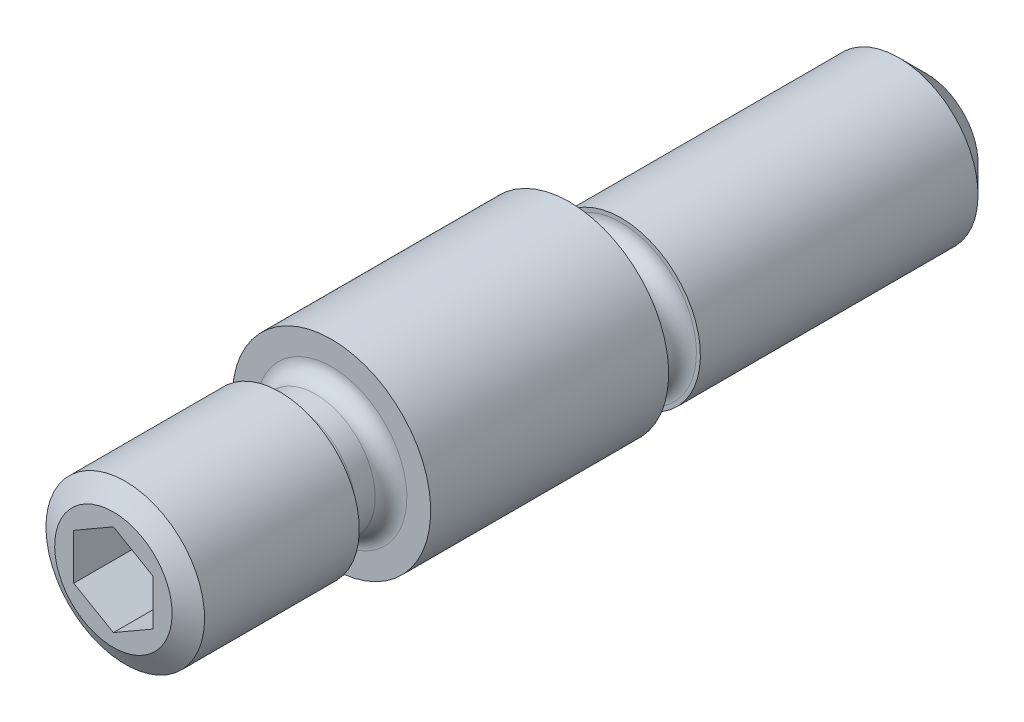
ISO-10303-21;
HEADER;
FILE_DESCRIPTION(('STEP AP214'),'2;1');
FILE_NAME('part.step','',(''),(''),'','','');
FILE_SCHEMA(('AUTOMOTIVE_DESIGN { 1 0 10303 214 1 1 1 1 }'));
ENDSEC;
DATA;
#1=APPLICATION_CONTEXT('core data for automotive mechanical design processes');
#2=APPLICATION_PROTOCOL_DEFINITION('international standard','automotive_design',2000,#1);
#3=PRODUCT_CONTEXT('',#1,'mechanical');
#4=PRODUCT('Part','Part','',(#3));
#5=PRODUCT_RELATED_PRODUCT_CATEGORY('part','',(#4));
#6=PRODUCT_DEFINITION_FORMATION('','',#4);
#7=PRODUCT_DEFINITION_CONTEXT('part definition',#1,'design');
#8=PRODUCT_DEFINITION('design','',#6,#7);
#9=PRODUCT_DEFINITION_SHAPE('','',#8);
#10=(LENGTH_UNIT() NAMED_UNIT(*) SI_UNIT(.MILLI.,.METRE.));
#11=(NAMED_UNIT(*) PLANE_ANGLE_UNIT() SI_UNIT($,.RADIAN.));
#12=(NAMED_UNIT(*) SI_UNIT($,.STERADIAN.) SOLID_ANGLE_UNIT());
#13=UNCERTAINTY_MEASURE_WITH_UNIT(LENGTH_MEASURE(1.E-05),#10,'distance_accuracy_value','');
#14=(GEOMETRIC_REPRESENTATION_CONTEXT(3) GLOBAL_UNCERTAINTY_ASSIGNED_CONTEXT((#13)) GLOBAL_UNIT_ASSIGNED_CONTEXT((#10,
#11,#12)) REPRESENTATION_CONTEXT('',''));
#15=CARTESIAN_POINT('',(0.,0.,0.));
#16=DIRECTION('',(0.,0.,1.));
#17=DIRECTION('',(1.,0.,0.));
#18=AXIS2_PLACEMENT_3D('',#15,#16,#17);
#19=CARTESIAN_POINT('',(0.,2.,-9.));
#20=DIRECTION('',(0.,0.,-1.));
#21=DIRECTION('',(0.,1.,0.));
#22=AXIS2_PLACEMENT_3D('',#19,#20,#21);
#23=PLANE('',#22);
#24=CARTESIAN_POINT('',(0.,0.,-9.));
#25=DIRECTION('',(0.,0.,-1.));
#26=DIRECTION('',(0.,1.,0.));
#27=AXIS2_PLACEMENT_3D('',#24,#25,#26);
#28=CIRCLE('',#27,1.3);
#29=CARTESIAN_POINT('',(0.,1.3,-9.));
#30=VERTEX_POINT('',#29);
#31=EDGE_CURVE('E22',#30,#30,#28,.T.);
#32=ORIENTED_EDGE('',*,*,#31,.T.);
#33=EDGE_LOOP('',(#32));
#34=FACE_BOUND('',#33,.T.);
#35=ADVANCED_FACE('F14',(#34),#23,.T.);
#36=CARTESIAN_POINT('',(0.,0.,-9.));
#37=DIRECTION('',(0.,0.,-1.));
#38=DIRECTION('',(0.,1.,0.));
#39=AXIS2_PLACEMENT_3D('',#36,#37,#38);
#40=CYLINDRICAL_SURFACE('',#39,1.5);
#41=CARTESIAN_POINT('',(0.,0.,-0.9));
#42=DIRECTION('',(0.,0.,1.));
#43=DIRECTION('',(0.,-1.,0.));
#44=AXIS2_PLACEMENT_3D('',#41,#42,#43);
#45=CIRCLE('',#44,1.5);
#46=CARTESIAN_POINT('',(0.,-1.5,-0.9));
#47=VERTEX_POINT('',#46);
#48=EDGE_CURVE('E154',#47,#47,#45,.T.);
#49=ORIENTED_EDGE('',*,*,#48,.T.);
#50=EDGE_LOOP('',(#49));
#51=FACE_BOUND('',#50,.T.);
#52=CARTESIAN_POINT('',(0.,0.,-0.4));
#53=DIRECTION('',(0.,0.,-1.));
#54=DIRECTION('',(0.,1.,0.));
#55=AXIS2_PLACEMENT_3D('',#52,#53,#54);
#56=CIRCLE('',#55,1.5);
#57=CARTESIAN_POINT('',(0.,1.5,-0.4));
#58=VERTEX_POINT('',#57);
#59=EDGE_CURVE('E151',#58,#58,#56,.T.);
#60=ORIENTED_EDGE('',*,*,#59,.T.);
#61=EDGE_LOOP('',(#60));
#62=FACE_BOUND('',#61,.T.);
#63=ADVANCED_FACE('F176',(#51,#62),#40,.T.);
#64=CARTESIAN_POINT('',(0.,1.5,-1.3));
#65=DIRECTION('',(0.,0.,1.));
#66=DIRECTION('',(0.,-1.,0.));
#67=AXIS2_PLACEMENT_3D('',#64,#65,#66);
#68=PLANE('',#67);
#69=CARTESIAN_POINT('',(0.,0.,-1.3));
#70=DIRECTION('',(0.,0.,1.));
#71=DIRECTION('',(0.,-1.,0.));
#72=AXIS2_PLACEMENT_3D('',#69,#70,#71);
#73=CIRCLE('',#72,1.9);
#74=CARTESIAN_POINT('',(0.,-1.9,-1.3));
#75=VERTEX_POINT('',#74);
#76=EDGE_CURVE('E148',#75,#75,#73,.F.);
#77=ORIENTED_EDGE('',*,*,#76,.T.);
#78=EDGE_LOOP('',(#77));
#79=FACE_BOUND('',#78,.T.);
#80=CARTESIAN_POINT('',(0.,0.,-1.3));
#81=DIRECTION('',(0.,0.,-1.));
#82=DIRECTION('',(0.,1.,0.));
#83=AXIS2_PLACEMENT_3D('',#80,#81,#82);
#84=CIRCLE('',#83,2.);
#85=CARTESIAN_POINT('',(0.,2.,-1.3));
#86=VERTEX_POINT('',#85);
#87=EDGE_CURVE('E136',#86,#86,#84,.T.);
#88=ORIENTED_EDGE('',*,*,#87,.F.);
#89=EDGE_LOOP('',(#88));
#90=FACE_BOUND('',#89,.T.);
#91=ADVANCED_FACE('F181',(#79,#90),#68,.T.);
#92=CARTESIAN_POINT('',(0.,0.,-9.));
#93=DIRECTION('',(0.,0.,-1.));
#94=DIRECTION('',(0.,1.,0.));
#95=AXIS2_PLACEMENT_3D('',#92,#93,#94);
#96=CYLINDRICAL_SURFACE('',#95,2.);
#97=CARTESIAN_POINT('',(0.,0.,-8.3));
#98=DIRECTION('',(0.,0.,-1.));
#99=DIRECTION('',(0.,1.,0.));
#100=AXIS2_PLACEMENT_3D('',#97,#98,#99);
#101=CIRCLE('',#100,2.);
#102=CARTESIAN_POINT('',(0.,2.,-8.3));
#103=VERTEX_POINT('',#102);
#104=EDGE_CURVE('E9',#103,#103,#101,.F.);
#105=ORIENTED_EDGE('',*,*,#104,.T.);
#106=EDGE_LOOP('',(#105));
#107=FACE_BOUND('',#106,.T.);
#108=ORIENTED_EDGE('',*,*,#87,.T.);
#109=EDGE_LOOP('',(#108));
#110=FACE_BOUND('',#109,.T.);
#111=ADVANCED_FACE('F235',(#107,#110),#96,.T.);
#112=CARTESIAN_POINT('',(0.,0.5,0.));
#113=DIRECTION('',(0.,0.,-1.));
#114=DIRECTION('',(0.,1.,0.));
#115=AXIS2_PLACEMENT_3D('',#112,#113,#114);
#116=PLANE('',#115);
#117=CARTESIAN_POINT('',(0.,0.,0.));
#118=DIRECTION('',(0.,0.,-1.));
#119=DIRECTION('',(0.,1.,0.));
#120=AXIS2_PLACEMENT_3D('',#117,#118,#119);
#121=CIRCLE('',#120,1.9);
#122=CARTESIAN_POINT('',(0.,1.9,0.));
#123=VERTEX_POINT('',#122);
#124=EDGE_CURVE('E157',#123,#123,#121,.F.);
#125=ORIENTED_EDGE('',*,*,#124,.T.);
#126=EDGE_LOOP('',(#125));
#127=FACE_BOUND('',#126,.T.);
#128=CARTESIAN_POINT('',(0.,0.5,0.));
#129=DIRECTION('',(0.,0.,-1.));
#130=DIRECTION('',(0.,1.,0.));
#131=AXIS2_PLACEMENT_3D('',#128,#129,#130);
#132=CIRCLE('',#131,2.5);
#133=CARTESIAN_POINT('',(0.,3.,0.));
#134=VERTEX_POINT('',#133);
#135=EDGE_CURVE('E133',#134,#134,#132,.T.);
#136=ORIENTED_EDGE('',*,*,#135,.T.);
#137=EDGE_LOOP('',(#136));
#138=FACE_BOUND('',#137,.T.);
#139=ADVANCED_FACE('F231',(#127,#138),#116,.T.);
#140=CARTESIAN_POINT('',(0.,0.5,0.));
#141=DIRECTION('',(0.,0.,-1.));
#142=DIRECTION('',(0.,1.,0.));
#143=AXIS2_PLACEMENT_3D('',#140,#141,#142);
#144=CYLINDRICAL_SURFACE('',#143,2.5);
#145=CARTESIAN_POINT('',(0.,0.5,6.));
#146=DIRECTION('',(0.,0.,-1.));
#147=DIRECTION('',(0.,1.,0.));
#148=AXIS2_PLACEMENT_3D('',#145,#146,#147);
#149=CIRCLE('',#148,2.5);
#150=CARTESIAN_POINT('',(0.,3.,6.));
#151=VERTEX_POINT('',#150);
#152=EDGE_CURVE('E130',#151,#151,#149,.T.);
#153=ORIENTED_EDGE('',*,*,#152,.T.);
#154=EDGE_LOOP('',(#153));
#155=FACE_BOUND('',#154,.T.);
#156=ORIENTED_EDGE('',*,*,#135,.F.);
#157=EDGE_LOOP('',(#156));
#158=FACE_BOUND('',#157,.T.);
#159=ADVANCED_FACE('F224',(#155,#158),#144,.T.);
#160=CARTESIAN_POINT('',(0.,3.,6.));
#161=DIRECTION('',(0.,0.,1.));
#162=DIRECTION('',(0.,-1.,0.));
#163=AXIS2_PLACEMENT_3D('',#160,#161,#162);
#164=PLANE('',#163);
#165=CARTESIAN_POINT('',(0.,0.5,6.));
#166=DIRECTION('',(0.,0.,1.));
#167=DIRECTION('',(0.,-1.,0.));
#168=AXIS2_PLACEMENT_3D('',#165,#166,#167);
#169=CIRCLE('',#168,1.9);
#170=CARTESIAN_POINT('',(0.,-1.4,6.));
#171=VERTEX_POINT('',#170);
#172=EDGE_CURVE('E139',#171,#171,#169,.F.);
#173=ORIENTED_EDGE('',*,*,#172,.T.);
#174=EDGE_LOOP('',(#173));
#175=FACE_BOUND('',#174,.T.);
#176=ORIENTED_EDGE('',*,*,#152,.F.);
#177=EDGE_LOOP('',(#176));
#178=FACE_BOUND('',#177,.T.);
#179=ADVANCED_FACE('F214',(#175,#178),#164,.T.);
#180=CARTESIAN_POINT('',(0.,0.5,0.));
#181=DIRECTION('',(0.,0.,-1.));
#182=DIRECTION('',(0.,1.,0.));
#183=AXIS2_PLACEMENT_3D('',#180,#181,#182);
#184=CYLINDRICAL_SURFACE('',#183,1.5);
#185=CARTESIAN_POINT('',(0.,0.5,6.4));
#186=DIRECTION('',(0.,0.,1.));
#187=DIRECTION('',(0.,-1.,0.));
#188=AXIS2_PLACEMENT_3D('',#185,#186,#187);
#189=CIRCLE('',#188,1.5);
#190=CARTESIAN_POINT('',(0.,-1.,6.4));
#191=VERTEX_POINT('',#190);
#192=EDGE_CURVE('E145',#191,#191,#189,.T.);
#193=ORIENTED_EDGE('',*,*,#192,.T.);
#194=EDGE_LOOP('',(#193));
#195=FACE_BOUND('',#194,.T.);
#196=CARTESIAN_POINT('',(0.,0.5,6.9));
#197=DIRECTION('',(0.,0.,-1.));
#198=DIRECTION('',(0.,1.,0.));
#199=AXIS2_PLACEMENT_3D('',#196,#197,#198);
#200=CIRCLE('',#199,1.5);
#201=CARTESIAN_POINT('',(0.,2.,6.9));
#202=VERTEX_POINT('',#201);
#203=EDGE_CURVE('E142',#202,#202,#200,.T.);
#204=ORIENTED_EDGE('',*,*,#203,.T.);
#205=EDGE_LOOP('',(#204));
#206=FACE_BOUND('',#205,.T.);
#207=ADVANCED_FACE('F211',(#195,#206),#184,.T.);
#208=CARTESIAN_POINT('',(0.,2.,7.3));
#209=DIRECTION('',(0.,0.,-1.));
#210=DIRECTION('',(0.,1.,0.));
#211=AXIS2_PLACEMENT_3D('',#208,#209,#210);
#212=PLANE('',#211);
#213=CARTESIAN_POINT('',(0.,0.5,7.3));
#214=DIRECTION('',(0.,0.,-1.));
#215=DIRECTION('',(0.,1.,0.));
#216=AXIS2_PLACEMENT_3D('',#213,#214,#215);
#217=CIRCLE('',#216,1.9);
#218=CARTESIAN_POINT('',(0.,2.4,7.3));
#219=VERTEX_POINT('',#218);
#220=EDGE_CURVE('E160',#219,#219,#217,.F.);
#221=ORIENTED_EDGE('',*,*,#220,.T.);
#222=EDGE_LOOP('',(#221));
#223=FACE_BOUND('',#222,.T.);
#224=CARTESIAN_POINT('',(0.,0.5,7.3));
#225=DIRECTION('',(0.,0.,-1.));
#226=DIRECTION('',(0.,1.,0.));
#227=AXIS2_PLACEMENT_3D('',#224,#225,#226);
#228=CIRCLE('',#227,2.);
#229=CARTESIAN_POINT('',(0.,2.5,7.3));
#230=VERTEX_POINT('',#229);
#231=EDGE_CURVE('E127',#230,#230,#228,.T.);
#232=ORIENTED_EDGE('',*,*,#231,.T.);
#233=EDGE_LOOP('',(#232));
#234=FACE_BOUND('',#233,.T.);
#235=ADVANCED_FACE('F213',(#223,#234),#212,.T.);
#236=CARTESIAN_POINT('',(0.,0.5,0.));
#237=DIRECTION('',(0.,0.,-1.));
#238=DIRECTION('',(0.,1.,0.));
#239=AXIS2_PLACEMENT_3D('',#236,#237,#238);
#240=CYLINDRICAL_SURFACE('',#239,2.);
#241=CARTESIAN_POINT('',(0.,0.5,11.2));
#242=DIRECTION('',(0.,0.,-1.));
#243=DIRECTION('',(0.,1.,0.));
#244=AXIS2_PLACEMENT_3D('',#241,#242,#243);
#245=CIRCLE('',#244,2.);
#246=CARTESIAN_POINT('',(0.,2.5,11.2));
#247=VERTEX_POINT('',#246);
#248=EDGE_CURVE('E124',#247,#247,#245,.T.);
#249=ORIENTED_EDGE('',*,*,#248,.T.);
#250=EDGE_LOOP('',(#249));
#251=FACE_BOUND('',#250,.T.);
#252=ORIENTED_EDGE('',*,*,#231,.F.);
#253=EDGE_LOOP('',(#252));
#254=FACE_BOUND('',#253,.T.);
#255=ADVANCED_FACE('F221',(#251,#254),#240,.T.);
#256=CARTESIAN_POINT('',(0.,0.5,11.2));
#257=DIRECTION('',(0.,0.,-1.));
#258=DIRECTION('',(0.,1.,0.));
#259=AXIS2_PLACEMENT_3D('',#256,#257,#258);
#260=CONICAL_SURFACE('',#259,2.,1.0471975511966);
#261=CARTESIAN_POINT('',(0.,0.5,11.5));
#262=DIRECTION('',(0.,0.,-1.));
#263=DIRECTION('',(0.,1.,0.));
#264=AXIS2_PLACEMENT_3D('',#261,#262,#263);
#265=CIRCLE('',#264,1.48038475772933);
#266=CARTESIAN_POINT('',(0.,1.98038475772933,11.5));
#267=VERTEX_POINT('',#266);
#268=EDGE_CURVE('E116',#267,#267,#265,.T.);
#269=ORIENTED_EDGE('',*,*,#268,.T.);
#270=EDGE_LOOP('',(#269));
#271=FACE_BOUND('',#270,.T.);
#272=ORIENTED_EDGE('',*,*,#248,.F.);
#273=EDGE_LOOP('',(#272));
#274=FACE_BOUND('',#273,.T.);
#275=ADVANCED_FACE('F296',(#271,#274),#260,.T.);
#276=CARTESIAN_POINT('',(0.,0.5,11.5));
#277=DIRECTION('',(0.,0.,1.));
#278=DIRECTION('',(0.,-1.,0.));
#279=AXIS2_PLACEMENT_3D('',#276,#277,#278);
#280=PLANE('',#279);
#281=DIRECTION('',(-0.866025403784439,0.5,0.));
#282=VECTOR('',#281,1.);
#283=CARTESIAN_POINT('',(1.,1.07735026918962,11.5));
#284=LINE('',#283,#282);
#285=CARTESIAN_POINT('',(1.,1.07735026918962,11.5));
#286=VERTEX_POINT('',#285);
#287=CARTESIAN_POINT('',(0.,1.65470053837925,11.5));
#288=VERTEX_POINT('',#287);
#289=EDGE_CURVE('E29',#286,#288,#284,.T.);
#290=ORIENTED_EDGE('',*,*,#289,.F.);
#291=DIRECTION('',(0.,1.,0.));
#292=VECTOR('',#291,1.);
#293=CARTESIAN_POINT('',(1.,-0.0773502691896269,11.5));
#294=LINE('',#293,#292);
#295=CARTESIAN_POINT('',(1.,-0.0773502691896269,11.5));
#296=VERTEX_POINT('',#295);
#297=EDGE_CURVE('E112',#296,#286,#294,.T.);
#298=ORIENTED_EDGE('',*,*,#297,.F.);
#299=DIRECTION('',(0.866025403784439,0.5,0.));
#300=VECTOR('',#299,1.);
#301=CARTESIAN_POINT('',(0.,-0.654700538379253,11.5));
#302=LINE('',#301,#300);
#303=CARTESIAN_POINT('',(0.,-0.654700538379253,11.5));
#304=VERTEX_POINT('',#303);
#305=EDGE_CURVE('E110',#304,#296,#302,.T.);
#306=ORIENTED_EDGE('',*,*,#305,.F.);
#307=DIRECTION('',(0.866025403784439,-0.5,0.));
#308=VECTOR('',#307,1.);
#309=CARTESIAN_POINT('',(-1.,-0.0773502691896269,11.5));
#310=LINE('',#309,#308);
#311=CARTESIAN_POINT('',(-1.,-0.0773502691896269,11.5));
#312=VERTEX_POINT('',#311);
#313=EDGE_CURVE('E77',#312,#304,#310,.T.);
#314=ORIENTED_EDGE('',*,*,#313,.F.);
#315=DIRECTION('',(0.,-1.,0.));
#316=VECTOR('',#315,1.);
#317=CARTESIAN_POINT('',(-1.,1.07735026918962,11.5));
#318=LINE('',#317,#316);
#319=CARTESIAN_POINT('',(-1.,1.07735026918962,11.5));
#320=VERTEX_POINT('',#319);
#321=EDGE_CURVE('E106',#320,#312,#318,.T.);
#322=ORIENTED_EDGE('',*,*,#321,.F.);
#323=DIRECTION('',(-0.866025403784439,-0.5,0.));
#324=VECTOR('',#323,1.);
#325=CARTESIAN_POINT('',(0.,1.65470053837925,11.5));
#326=LINE('',#325,#324);
#327=EDGE_CURVE('E103',#288,#320,#326,.T.);
#328=ORIENTED_EDGE('',*,*,#327,.F.);
#329=EDGE_LOOP('',(#290,#298,#306,#314,#322,#328));
#330=FACE_BOUND('',#329,.T.);
#331=ORIENTED_EDGE('',*,*,#268,.F.);
#332=EDGE_LOOP('',(#331));
#333=FACE_BOUND('',#332,.T.);
#334=ADVANCED_FACE('F190',(#330,#333),#280,.T.);
#335=CARTESIAN_POINT('',(0.,0.5,6.4));
#336=DIRECTION('',(0.,0.,1.));
#337=DIRECTION('',(0.,-1.,0.));
#338=AXIS2_PLACEMENT_3D('',#335,#336,#337);
#339=TOROIDAL_SURFACE('',#338,1.9,0.4);
#340=ORIENTED_EDGE('',*,*,#192,.F.);
#341=EDGE_LOOP('',(#340));
#342=FACE_BOUND('',#341,.T.);
#343=ORIENTED_EDGE('',*,*,#172,.F.);
#344=EDGE_LOOP('',(#343));
#345=FACE_BOUND('',#344,.T.);
#346=ADVANCED_FACE('F186',(#342,#345),#339,.F.);
#347=CARTESIAN_POINT('',(0.,0.,-0.9));
#348=DIRECTION('',(0.,0.,1.));
#349=DIRECTION('',(0.,-1.,0.));
#350=AXIS2_PLACEMENT_3D('',#347,#348,#349);
#351=TOROIDAL_SURFACE('',#350,1.9,0.4);
#352=ORIENTED_EDGE('',*,*,#48,.F.);
#353=EDGE_LOOP('',(#352));
#354=FACE_BOUND('',#353,.T.);
#355=ORIENTED_EDGE('',*,*,#76,.F.);
#356=EDGE_LOOP('',(#355));
#357=FACE_BOUND('',#356,.T.);
#358=ADVANCED_FACE('F189',(#354,#357),#351,.F.);
#359=CARTESIAN_POINT('',(0.,0.,-0.4));
#360=DIRECTION('',(0.,0.,-1.));
#361=DIRECTION('',(0.,1.,0.));
#362=AXIS2_PLACEMENT_3D('',#359,#360,#361);
#363=TOROIDAL_SURFACE('',#362,1.9,0.4);
#364=ORIENTED_EDGE('',*,*,#59,.F.);
#365=EDGE_LOOP('',(#364));
#366=FACE_BOUND('',#365,.T.);
#367=ORIENTED_EDGE('',*,*,#124,.F.);
#368=EDGE_LOOP('',(#367));
#369=FACE_BOUND('',#368,.T.);
#370=ADVANCED_FACE('F194',(#366,#369),#363,.F.);
#371=CARTESIAN_POINT('',(0.,0.5,6.9));
#372=DIRECTION('',(0.,0.,-1.));
#373=DIRECTION('',(0.,1.,0.));
#374=AXIS2_PLACEMENT_3D('',#371,#372,#373);
#375=TOROIDAL_SURFACE('',#374,1.9,0.4);
#376=ORIENTED_EDGE('',*,*,#220,.F.);
#377=EDGE_LOOP('',(#376));
#378=FACE_BOUND('',#377,.T.);
#379=ORIENTED_EDGE('',*,*,#203,.F.);
#380=EDGE_LOOP('',(#379));
#381=FACE_BOUND('',#380,.T.);
#382=ADVANCED_FACE('F197',(#378,#381),#375,.F.);
#383=CARTESIAN_POINT('',(1.,1.07735026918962,9.));
#384=DIRECTION('',(0.5,0.866025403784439,0.));
#385=DIRECTION('',(0.866025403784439,-0.5,0.));
#386=AXIS2_PLACEMENT_3D('',#383,#384,#385);
#387=PLANE('',#386);
#388=ORIENTED_EDGE('',*,*,#289,.T.);
#389=DIRECTION('',(0.,0.,1.));
#390=VECTOR('',#389,1.);
#391=CARTESIAN_POINT('',(0.,1.65470053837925,9.));
#392=LINE('',#391,#390);
#393=CARTESIAN_POINT('',(0.,1.65470053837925,9.));
#394=VERTEX_POINT('',#393);
#395=EDGE_CURVE('E59',#394,#288,#392,.T.);
#396=ORIENTED_EDGE('',*,*,#395,.F.);
#397=DIRECTION('',(-0.866025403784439,0.5,0.));
#398=VECTOR('',#397,1.);
#399=CARTESIAN_POINT('',(1.,1.07735026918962,9.));
#400=LINE('',#399,#398);
#401=CARTESIAN_POINT('',(1.,1.07735026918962,9.));
#402=VERTEX_POINT('',#401);
#403=EDGE_CURVE('E114',#402,#394,#400,.T.);
#404=ORIENTED_EDGE('',*,*,#403,.F.);
#405=DIRECTION('',(0.,0.,1.));
#406=VECTOR('',#405,1.);
#407=CARTESIAN_POINT('',(1.,1.07735026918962,9.));
#408=LINE('',#407,#406);
#409=EDGE_CURVE('E37',#402,#286,#408,.T.);
#410=ORIENTED_EDGE('',*,*,#409,.T.);
#411=EDGE_LOOP('',(#388,#396,#404,#410));
#412=FACE_BOUND('',#411,.T.);
#413=ADVANCED_FACE('F200',(#412),#387,.F.);
#414=CARTESIAN_POINT('',(1.,-0.0773502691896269,9.));
#415=DIRECTION('',(1.,0.,0.));
#416=DIRECTION('',(0.,0.,-1.));
#417=AXIS2_PLACEMENT_3D('',#414,#415,#416);
#418=PLANE('',#417);
#419=ORIENTED_EDGE('',*,*,#297,.T.);
#420=ORIENTED_EDGE('',*,*,#409,.F.);
#421=DIRECTION('',(0.,1.,0.));
#422=VECTOR('',#421,1.);
#423=CARTESIAN_POINT('',(1.,-0.0773502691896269,9.));
#424=LINE('',#423,#422);
#425=CARTESIAN_POINT('',(1.,-0.0773502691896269,9.));
#426=VERTEX_POINT('',#425);
#427=EDGE_CURVE('E89',#426,#402,#424,.T.);
#428=ORIENTED_EDGE('',*,*,#427,.F.);
#429=DIRECTION('',(0.,0.,1.));
#430=VECTOR('',#429,1.);
#431=CARTESIAN_POINT('',(1.,-0.0773502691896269,9.));
#432=LINE('',#431,#430);
#433=EDGE_CURVE('E81',#426,#296,#432,.T.);
#434=ORIENTED_EDGE('',*,*,#433,.T.);
#435=EDGE_LOOP('',(#419,#420,#428,#434));
#436=FACE_BOUND('',#435,.T.);
#437=ADVANCED_FACE('F205',(#436),#418,.F.);
#438=CARTESIAN_POINT('',(0.,-0.654700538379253,9.));
#439=DIRECTION('',(0.5,-0.866025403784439,0.));
#440=DIRECTION('',(-0.866025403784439,-0.5,0.));
#441=AXIS2_PLACEMENT_3D('',#438,#439,#440);
#442=PLANE('',#441);
#443=ORIENTED_EDGE('',*,*,#305,.T.);
#444=ORIENTED_EDGE('',*,*,#433,.F.);
#445=DIRECTION('',(0.866025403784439,0.5,0.));
#446=VECTOR('',#445,1.);
#447=CARTESIAN_POINT('',(0.,-0.654700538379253,9.));
#448=LINE('',#447,#446);
#449=CARTESIAN_POINT('',(0.,-0.654700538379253,9.));
#450=VERTEX_POINT('',#449);
#451=EDGE_CURVE('E85',#450,#426,#448,.T.);
#452=ORIENTED_EDGE('',*,*,#451,.F.);
#453=DIRECTION('',(0.,0.,1.));
#454=VECTOR('',#453,1.);
#455=CARTESIAN_POINT('',(0.,-0.654700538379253,9.));
#456=LINE('',#455,#454);
#457=EDGE_CURVE('E70',#450,#304,#456,.T.);
#458=ORIENTED_EDGE('',*,*,#457,.T.);
#459=EDGE_LOOP('',(#443,#444,#452,#458));
#460=FACE_BOUND('',#459,.T.);
#461=ADVANCED_FACE('F86',(#460),#442,.F.);
#462=CARTESIAN_POINT('',(-1.,-0.0773502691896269,9.));
#463=DIRECTION('',(-0.5,-0.866025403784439,0.));
#464=DIRECTION('',(-0.866025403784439,0.5,0.));
#465=AXIS2_PLACEMENT_3D('',#462,#463,#464);
#466=PLANE('',#465);
#467=ORIENTED_EDGE('',*,*,#313,.T.);
#468=ORIENTED_EDGE('',*,*,#457,.F.);
#469=DIRECTION('',(0.866025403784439,-0.5,0.));
#470=VECTOR('',#469,1.);
#471=CARTESIAN_POINT('',(-1.,-0.0773502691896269,9.));
#472=LINE('',#471,#470);
#473=CARTESIAN_POINT('',(-1.,-0.0773502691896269,9.));
#474=VERTEX_POINT('',#473);
#475=EDGE_CURVE('E74',#474,#450,#472,.T.);
#476=ORIENTED_EDGE('',*,*,#475,.F.);
#477=DIRECTION('',(0.,0.,1.));
#478=VECTOR('',#477,1.);
#479=CARTESIAN_POINT('',(-1.,-0.0773502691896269,9.));
#480=LINE('',#479,#478);
#481=EDGE_CURVE('E82',#474,#312,#480,.T.);
#482=ORIENTED_EDGE('',*,*,#481,.T.);
#483=EDGE_LOOP('',(#467,#468,#476,#482));
#484=FACE_BOUND('',#483,.T.);
#485=ADVANCED_FACE('F72',(#484),#466,.F.);
#486=CARTESIAN_POINT('',(-1.,1.07735026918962,9.));
#487=DIRECTION('',(-1.,0.,0.));
#488=DIRECTION('',(0.,0.,1.));
#489=AXIS2_PLACEMENT_3D('',#486,#487,#488);
#490=PLANE('',#489);
#491=ORIENTED_EDGE('',*,*,#321,.T.);
#492=ORIENTED_EDGE('',*,*,#481,.F.);
#493=DIRECTION('',(0.,-1.,0.));
#494=VECTOR('',#493,1.);
#495=CARTESIAN_POINT('',(-1.,1.07735026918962,9.));
#496=LINE('',#495,#494);
#497=CARTESIAN_POINT('',(-1.,1.07735026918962,9.));
#498=VERTEX_POINT('',#497);
#499=EDGE_CURVE('E95',#498,#474,#496,.T.);
#500=ORIENTED_EDGE('',*,*,#499,.F.);
#501=DIRECTION('',(0.,0.,1.));
#502=VECTOR('',#501,1.);
#503=CARTESIAN_POINT('',(-1.,1.07735026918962,9.));
#504=LINE('',#503,#502);
#505=EDGE_CURVE('E119',#498,#320,#504,.T.);
#506=ORIENTED_EDGE('',*,*,#505,.T.);
#507=EDGE_LOOP('',(#491,#492,#500,#506));
#508=FACE_BOUND('',#507,.T.);
#509=ADVANCED_FACE('F367',(#508),#490,.F.);
#510=CARTESIAN_POINT('',(0.,1.65470053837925,9.));
#511=DIRECTION('',(-0.5,0.866025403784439,0.));
#512=DIRECTION('',(0.866025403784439,0.5,0.));
#513=AXIS2_PLACEMENT_3D('',#510,#511,#512);
#514=PLANE('',#513);
#515=ORIENTED_EDGE('',*,*,#327,.T.);
#516=ORIENTED_EDGE('',*,*,#505,.F.);
#517=DIRECTION('',(-0.866025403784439,-0.5,0.));
#518=VECTOR('',#517,1.);
#519=CARTESIAN_POINT('',(0.,1.65470053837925,9.));
#520=LINE('',#519,#518);
#521=EDGE_CURVE('E97',#394,#498,#520,.T.);
#522=ORIENTED_EDGE('',*,*,#521,.F.);
#523=ORIENTED_EDGE('',*,*,#395,.T.);
#524=EDGE_LOOP('',(#515,#516,#522,#523));
#525=FACE_BOUND('',#524,.T.);
#526=ADVANCED_FACE('F172',(#525),#514,.F.);
#527=CARTESIAN_POINT('',(0.,1.65470053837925,9.));
#528=DIRECTION('',(0.,0.,1.));
#529=DIRECTION('',(1.,0.,0.));
#530=AXIS2_PLACEMENT_3D('',#527,#528,#529);
#531=PLANE('',#530);
#532=ORIENTED_EDGE('',*,*,#403,.T.);
#533=ORIENTED_EDGE('',*,*,#521,.T.);
#534=ORIENTED_EDGE('',*,*,#499,.T.);
#535=ORIENTED_EDGE('',*,*,#475,.T.);
#536=ORIENTED_EDGE('',*,*,#451,.T.);
#537=ORIENTED_EDGE('',*,*,#427,.T.);
#538=EDGE_LOOP('',(#532,#533,#534,#535,#536,#537));
#539=FACE_BOUND('',#538,.T.);
#540=ADVANCED_FACE('F92',(#539),#531,.T.);
#541=CARTESIAN_POINT('',(0.,0.,-9.));
#542=DIRECTION('',(0.,0.,1.));
#543=DIRECTION('',(0.,-1.,0.));
#544=AXIS2_PLACEMENT_3D('',#541,#542,#543);
#545=CONICAL_SURFACE('',#544,1.3,0.785398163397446);
#546=ORIENTED_EDGE('',*,*,#104,.F.);
#547=EDGE_LOOP('',(#546));
#548=FACE_BOUND('',#547,.T.);
#549=ORIENTED_EDGE('',*,*,#31,.F.);
#550=EDGE_LOOP('',(#549));
#551=FACE_BOUND('',#550,.T.);
#552=ADVANCED_FACE('F16',(#548,#551),#545,.T.);
#553=CLOSED_SHELL('',(#35,#63,#91,#111,#139,#159,#179,#207,#235,#255,#275,#334,#346,#358,#370,
#382,#413,#437,#461,#485,#509,#526,#540,#552));
#554=MANIFOLD_SOLID_BREP('B1',#553);
#555=ADVANCED_BREP_SHAPE_REPRESENTATION('',(#18,#554),#14);
#556=SHAPE_DEFINITION_REPRESENTATION(#9,#555);
ENDSEC;
END-ISO-10303-21;
